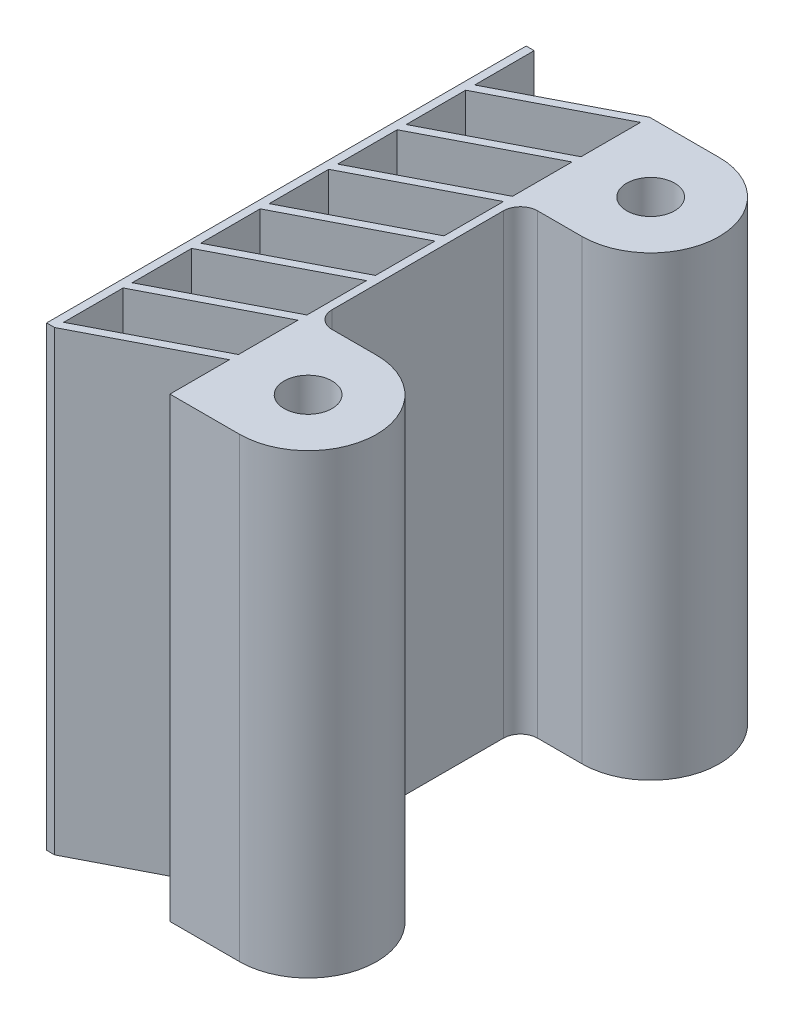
from build123d import *

# Parameters (mm, degrees)
SKETCH_1_R          = 2.1
EXTRUDE_1_DEPTH     = 40
FILLET_1_R          = 1.5
CUT_EXTRUDE_1_DEPTH = 353.343880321


with BuildPart() as part:
    # Sketch 1 → Extrude 1 (new body)
    with BuildSketch(Plane(origin=(0, 0, 0), x_dir=(1, 0, 0), z_dir=(0, 1, 0))):
        with BuildLine():
            Line((-237, -199), (-253.9, -199))
            Line((-253.9, -199), (-253.9, -241))
            Line((-253.9, -241), (-237, -241))
            ThreePointArc((-237, -241), (-231, -235), (-237, -229))
            Line((-237, -229), (-242.4, -229))
            Line((-242.4, -229), (-242.4, -211))
            Line((-242.4, -211), (-237, -211))
            ThreePointArc((-237, -211), (-231, -205), (-237, -199))
        make_face()
        with Locations(Location((-237, -235, 0), (0, 0, 270))):
            Circle(SKETCH_1_R, mode=Mode.SUBTRACT)
        with Locations(Location((-237, -205, 0), (0, 0, 270))):
            Circle(SKETCH_1_R, mode=Mode.SUBTRACT)
    extrude(amount=EXTRUDE_1_DEPTH)

    # Fillet 1
    fillet_1_edges = [part.edges().sort_by_distance(p)[0] for p in [
        (-242.4, 20, 211),
        (-242.4, 20, 229),
    ]]
    fillet(fillet_1_edges, radius=FILLET_1_R)

    # Sketch 2 → Cut-Extrude 1 (cut, through all)
    with BuildSketch(Plane(origin=(0, 40, 0), x_dir=(1, 0, 0), z_dir=(0, 1, 0))):
        Polygon((-253.2, -199), (-243.1, -193.787717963), (-243.1, -199), (-253.2, -204.212282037), align=None)
        Polygon((-253.2, -205), (-243.1, -199.787717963), (-243.1, -205), (-253.2, -210.212282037), align=None)
        Polygon((-253.2, -211), (-243.1, -205.787717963), (-243.1, -211), (-253.2, -216.212282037), align=None)
        Polygon((-253.2, -217), (-243.1, -211.787717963), (-243.1, -217), (-253.2, -222.212282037), align=None)
        Polygon((-253.2, -223), (-243.1, -217.787717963), (-243.1, -223), (-253.2, -228.212282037), align=None)
        Polygon((-253.2, -229), (-243.1, -223.787717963), (-243.1, -229), (-253.2, -234.212282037), align=None)
        Polygon((-253.2, -235), (-243.1, -229.787717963), (-243.1, -235), (-253.2, -240.212282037), align=None)
        Polygon((-253.2, -241), (-243.1, -235.787717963), (-243.1, -241), (-253.2, -246.212282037), align=None)
        Polygon((-253.2, -247), (-243.1, -241.787717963), (-243.1, -247), (-253.2, -252.212282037), align=None)
        Polygon((-253.2, -253), (-243.1, -247.787717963), (-243.1, -253), (-253.2, -258.212282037), align=None)
        Polygon((-253.2, -259), (-243.1, -253.787717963), (-243.1, -259), (-253.2, -264.212282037), align=None)
        Polygon((-253.2, -265), (-243.1, -259.787717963), (-243.1, -265), (-253.2, -270.212282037), align=None)
        Polygon((-253.2, -271), (-243.1, -265.787717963), (-243.1, -271), (-253.2, -276.212282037), align=None)
    extrude(amount=-CUT_EXTRUDE_1_DEPTH, mode=Mode.SUBTRACT)


solid = part.part
